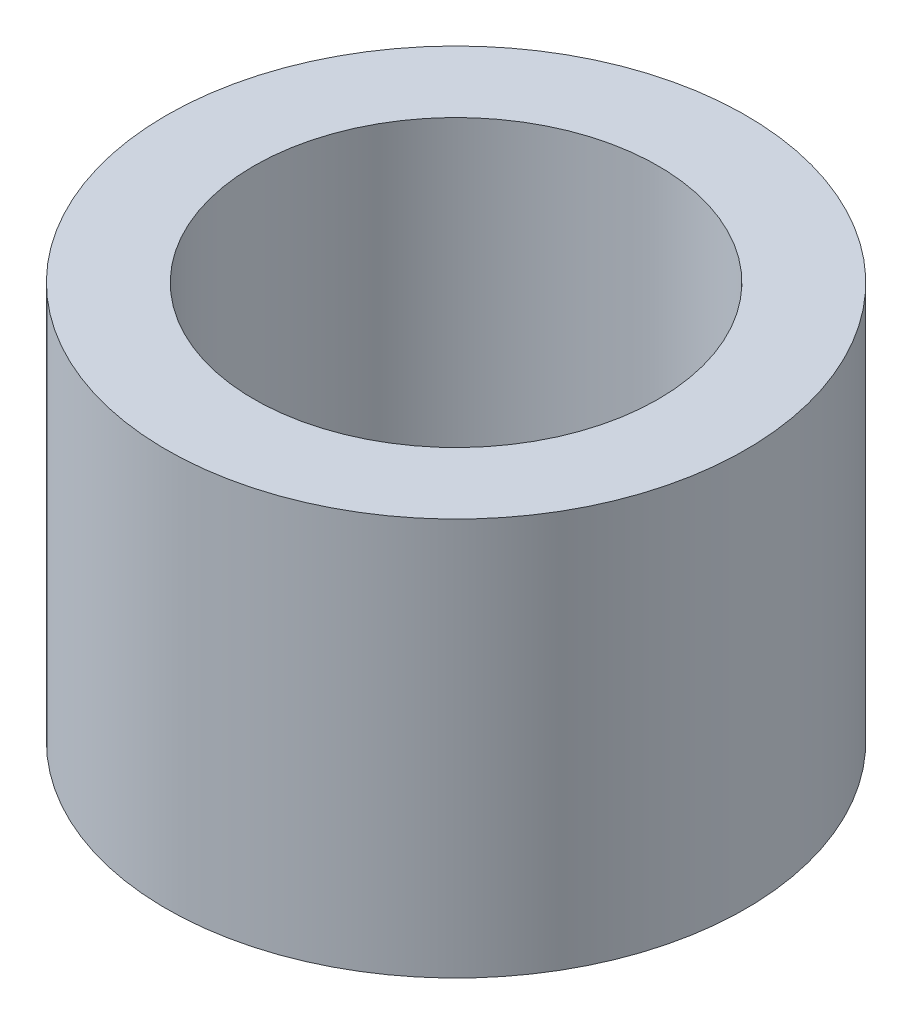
from build123d import *

# Parameters (mm, degrees)
SKETCH1_W = 0.65
SKETCH1_H = 2.95


with BuildPart() as part:
    # Sketch1 → Revolve1 (revolve)
    with BuildSketch(Plane.XY, mode=Mode.PRIVATE) as revolve1_sk:
        with Locations((1.825, 1.475)):
            Rectangle(SKETCH1_W, SKETCH1_H)
    revolve(revolve1_sk.sketch.rotate(Axis((0, 25.272286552, 0), (0, -1, 0)), 180), axis=Axis((0, 25.272286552, 0), (0, -1, 0)))


solid = part.part
